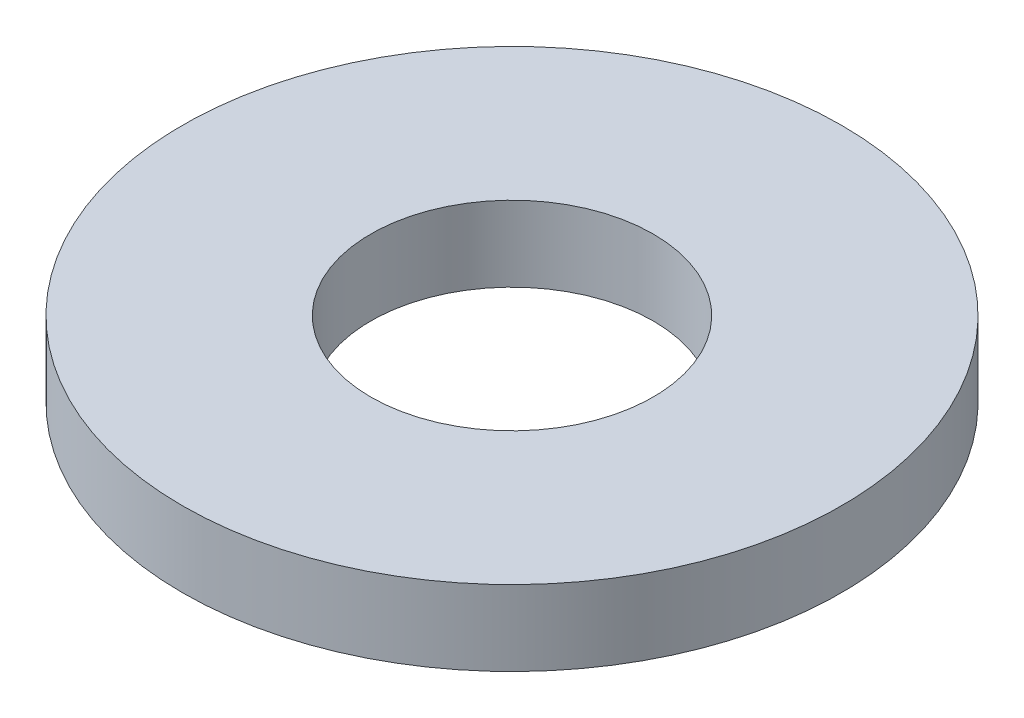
from build123d import *

# Parameters (mm, degrees)
SKETCH_1_R      = 3.5
SKETCH_1_R_2    = 1.5
EXTRUDE_1_DEPTH = 0.8


with BuildPart() as part:
    # Sketch 1 → Extrude 1 (new body)
    with BuildSketch(Plane(origin=(0, 0, 0), x_dir=(1, 0, 0), z_dir=(0, 1, 0))):
        with Locations(Location((0, 0, 0), (0, 0, 270))):
            Circle(SKETCH_1_R)
        with Locations(Location((0, 0, 0), (0, 0, 270))):
            Circle(SKETCH_1_R_2, mode=Mode.SUBTRACT)
    extrude(amount=EXTRUDE_1_DEPTH)


solid = part.part
